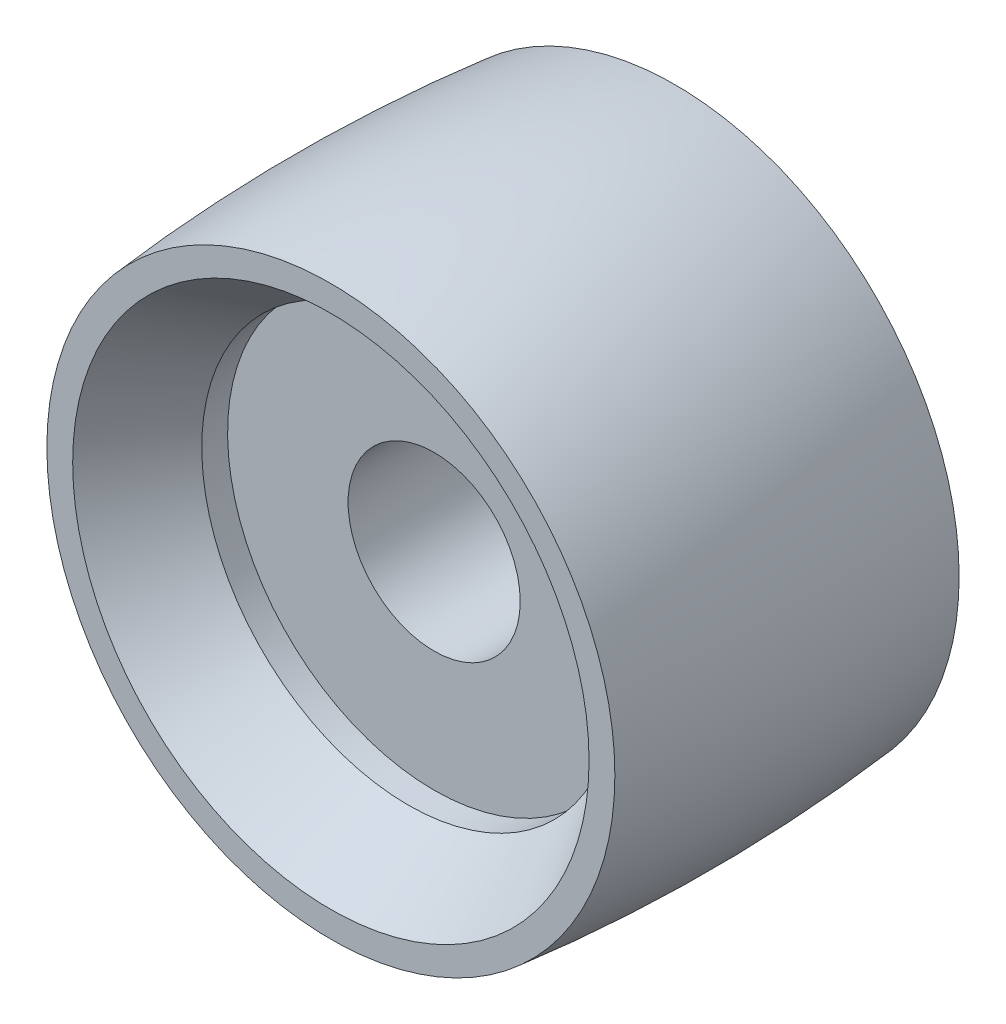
ISO-10303-21;
HEADER;
FILE_DESCRIPTION(('STEP AP214'),'2;1');
FILE_NAME('part.step','',(''),(''),'','','');
FILE_SCHEMA(('AUTOMOTIVE_DESIGN { 1 0 10303 214 1 1 1 1 }'));
ENDSEC;
DATA;
#1=APPLICATION_CONTEXT('core data for automotive mechanical design processes');
#2=APPLICATION_PROTOCOL_DEFINITION('international standard','automotive_design',2000,#1);
#3=PRODUCT_CONTEXT('',#1,'mechanical');
#4=PRODUCT('Part','Part','',(#3));
#5=PRODUCT_RELATED_PRODUCT_CATEGORY('part','',(#4));
#6=PRODUCT_DEFINITION_FORMATION('','',#4);
#7=PRODUCT_DEFINITION_CONTEXT('part definition',#1,'design');
#8=PRODUCT_DEFINITION('design','',#6,#7);
#9=PRODUCT_DEFINITION_SHAPE('','',#8);
#10=(LENGTH_UNIT() NAMED_UNIT(*) SI_UNIT(.MILLI.,.METRE.));
#11=(NAMED_UNIT(*) PLANE_ANGLE_UNIT() SI_UNIT($,.RADIAN.));
#12=(NAMED_UNIT(*) SI_UNIT($,.STERADIAN.) SOLID_ANGLE_UNIT());
#13=UNCERTAINTY_MEASURE_WITH_UNIT(LENGTH_MEASURE(1.E-05),#10,'distance_accuracy_value','');
#14=(GEOMETRIC_REPRESENTATION_CONTEXT(3) GLOBAL_UNCERTAINTY_ASSIGNED_CONTEXT((#13)) GLOBAL_UNIT_ASSIGNED_CONTEXT((#10,
#11,#12)) REPRESENTATION_CONTEXT('',''));
#15=CARTESIAN_POINT('',(0.,0.,0.));
#16=DIRECTION('',(0.,0.,1.));
#17=DIRECTION('',(1.,0.,0.));
#18=AXIS2_PLACEMENT_3D('',#15,#16,#17);
#19=CARTESIAN_POINT('',(0.,0.,4.));
#20=DIRECTION('',(0.,0.,1.));
#21=DIRECTION('',(0.,-1.,0.));
#22=AXIS2_PLACEMENT_3D('',#19,#20,#21);
#23=CYLINDRICAL_SURFACE('',#22,12.);
#24=CARTESIAN_POINT('',(0.,0.,4.));
#25=DIRECTION('',(0.,0.,1.));
#26=DIRECTION('',(0.,-1.,0.));
#27=AXIS2_PLACEMENT_3D('',#24,#25,#26);
#28=CIRCLE('',#27,12.);
#29=CARTESIAN_POINT('',(0.,-12.,4.));
#30=VERTEX_POINT('',#29);
#31=EDGE_CURVE('E16',#30,#30,#28,.F.);
#32=ORIENTED_EDGE('',*,*,#31,.T.);
#33=EDGE_LOOP('',(#32));
#34=FACE_BOUND('',#33,.T.);
#35=CARTESIAN_POINT('',(0.,0.,5.5));
#36=DIRECTION('',(0.,0.,1.));
#37=DIRECTION('',(1.,0.,0.));
#38=AXIS2_PLACEMENT_3D('',#35,#36,#37);
#39=CIRCLE('',#38,12.);
#40=CARTESIAN_POINT('',(12.,0.,5.50000000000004));
#41=VERTEX_POINT('',#40);
#42=EDGE_CURVE('E28',#41,#41,#39,.T.);
#43=ORIENTED_EDGE('',*,*,#42,.T.);
#44=EDGE_LOOP('',(#43));
#45=FACE_BOUND('',#44,.T.);
#46=ADVANCED_FACE('F12',(#34,#45),#23,.F.);
#47=CARTESIAN_POINT('',(0.,0.,5.5));
#48=DIRECTION('',(0.,0.,1.));
#49=DIRECTION('',(1.,0.,0.));
#50=AXIS2_PLACEMENT_3D('',#47,#48,#49);
#51=CONICAL_SURFACE('',#50,12.,0.588002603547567);
#52=ORIENTED_EDGE('',*,*,#42,.F.);
#53=EDGE_LOOP('',(#52));
#54=FACE_BOUND('',#53,.T.);
#55=CARTESIAN_POINT('',(0.,0.,10.));
#56=DIRECTION('',(0.,0.,1.));
#57=DIRECTION('',(1.,0.,0.));
#58=AXIS2_PLACEMENT_3D('',#55,#56,#57);
#59=CIRCLE('',#58,15.);
#60=CARTESIAN_POINT('',(15.,0.,10.));
#61=VERTEX_POINT('',#60);
#62=EDGE_CURVE('E44',#61,#61,#59,.T.);
#63=ORIENTED_EDGE('',*,*,#62,.T.);
#64=EDGE_LOOP('',(#63));
#65=FACE_BOUND('',#64,.T.);
#66=ADVANCED_FACE('F56',(#54,#65),#51,.F.);
#67=CARTESIAN_POINT('',(12.144,-12.185787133,4.));
#68=DIRECTION('',(0.,0.,-1.));
#69=DIRECTION('',(-1.,0.,0.));
#70=AXIS2_PLACEMENT_3D('',#67,#68,#69);
#71=PLANE('',#70);
#72=CARTESIAN_POINT('',(0.,0.,4.));
#73=DIRECTION('',(0.,0.,1.));
#74=DIRECTION('',(1.,0.,0.));
#75=AXIS2_PLACEMENT_3D('',#72,#73,#74);
#76=CIRCLE('',#75,5.);
#77=CARTESIAN_POINT('',(5.,0.,4.));
#78=VERTEX_POINT('',#77);
#79=EDGE_CURVE('E42',#78,#78,#76,.F.);
#80=ORIENTED_EDGE('',*,*,#79,.T.);
#81=EDGE_LOOP('',(#80));
#82=FACE_BOUND('',#81,.T.);
#83=ORIENTED_EDGE('',*,*,#31,.F.);
#84=EDGE_LOOP('',(#83));
#85=FACE_BOUND('',#84,.T.);
#86=ADVANCED_FACE('F53',(#82,#85),#71,.F.);
#87=CARTESIAN_POINT('',(16.696728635,-16.754181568,10.));
#88=DIRECTION('',(0.,0.,-1.));
#89=DIRECTION('',(-1.,0.,0.));
#90=AXIS2_PLACEMENT_3D('',#87,#88,#89);
#91=PLANE('',#90);
#92=ORIENTED_EDGE('',*,*,#62,.F.);
#93=EDGE_LOOP('',(#92));
#94=FACE_BOUND('',#93,.T.);
#95=CARTESIAN_POINT('',(0.,0.,9.99999999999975));
#96=DIRECTION('',(0.,0.,1.));
#97=DIRECTION('',(1.,0.,0.));
#98=AXIS2_PLACEMENT_3D('',#95,#96,#97);
#99=CIRCLE('',#98,16.498743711);
#100=CARTESIAN_POINT('',(16.498743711,0.,9.99999999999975));
#101=VERTEX_POINT('',#100);
#102=EDGE_CURVE('E39',#101,#101,#99,.F.);
#103=ORIENTED_EDGE('',*,*,#102,.F.);
#104=EDGE_LOOP('',(#103));
#105=FACE_BOUND('',#104,.T.);
#106=ADVANCED_FACE('F55',(#94,#105),#91,.F.);
#107=CARTESIAN_POINT('',(0.,0.,-4.));
#108=DIRECTION('',(0.,0.,1.));
#109=DIRECTION('',(1.,0.,0.));
#110=AXIS2_PLACEMENT_3D('',#107,#108,#109);
#111=CYLINDRICAL_SURFACE('',#110,5.);
#112=CARTESIAN_POINT('',(0.,0.,-4.));
#113=DIRECTION('',(0.,0.,1.));
#114=DIRECTION('',(1.,0.,0.));
#115=AXIS2_PLACEMENT_3D('',#112,#113,#114);
#116=CIRCLE('',#115,5.);
#117=CARTESIAN_POINT('',(5.,0.,-4.));
#118=VERTEX_POINT('',#117);
#119=EDGE_CURVE('E36',#118,#118,#116,.F.);
#120=ORIENTED_EDGE('',*,*,#119,.T.);
#121=EDGE_LOOP('',(#120));
#122=FACE_BOUND('',#121,.T.);
#123=ORIENTED_EDGE('',*,*,#79,.F.);
#124=EDGE_LOOP('',(#123));
#125=FACE_BOUND('',#124,.T.);
#126=ADVANCED_FACE('F65',(#122,#125),#111,.F.);
#127=CARTESIAN_POINT('',(0.,0.,0.));
#128=DIRECTION('',(0.,0.,1.));
#129=DIRECTION('',(1.,0.,0.));
#130=AXIS2_PLACEMENT_3D('',#127,#128,#129);
#131=DEGENERATE_TOROIDAL_SURFACE('',#130,83.0000000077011,100.000000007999,.F.);
#132=ORIENTED_EDGE('',*,*,#102,.T.);
#133=EDGE_LOOP('',(#132));
#134=FACE_BOUND('',#133,.T.);
#135=CARTESIAN_POINT('',(0.,0.,-10.0000000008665));
#136=DIRECTION('',(0.,0.,1.));
#137=DIRECTION('',(1.,0.,0.));
#138=AXIS2_PLACEMENT_3D('',#135,#136,#137);
#139=CIRCLE('',#138,16.4987437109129);
#140=CARTESIAN_POINT('',(16.4987437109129,0.,-10.0000000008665));
#141=VERTEX_POINT('',#140);
#142=EDGE_CURVE('E33',#141,#141,#139,.T.);
#143=ORIENTED_EDGE('',*,*,#142,.T.);
#144=EDGE_LOOP('',(#143));
#145=FACE_BOUND('',#144,.T.);
#146=ADVANCED_FACE('F85',(#134,#145),#131,.F.);
#147=CARTESIAN_POINT('',(-12.144,-12.185787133,-4.));
#148=DIRECTION('',(0.,0.,1.));
#149=DIRECTION('',(1.,0.,0.));
#150=AXIS2_PLACEMENT_3D('',#147,#148,#149);
#151=PLANE('',#150);
#152=ORIENTED_EDGE('',*,*,#119,.F.);
#153=EDGE_LOOP('',(#152));
#154=FACE_BOUND('',#153,.T.);
#155=CARTESIAN_POINT('',(0.,0.,-4.));
#156=DIRECTION('',(0.,0.,1.));
#157=DIRECTION('',(1.,0.,0.));
#158=AXIS2_PLACEMENT_3D('',#155,#156,#157);
#159=CIRCLE('',#158,12.);
#160=CARTESIAN_POINT('',(12.,0.,-4.));
#161=VERTEX_POINT('',#160);
#162=EDGE_CURVE('E25',#161,#161,#159,.F.);
#163=ORIENTED_EDGE('',*,*,#162,.T.);
#164=EDGE_LOOP('',(#163));
#165=FACE_BOUND('',#164,.T.);
#166=ADVANCED_FACE('F135',(#154,#165),#151,.F.);
#167=CARTESIAN_POINT('',(-16.696728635,-16.754181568,-10.));
#168=DIRECTION('',(0.,0.,1.));
#169=DIRECTION('',(1.,0.,0.));
#170=AXIS2_PLACEMENT_3D('',#167,#168,#169);
#171=PLANE('',#170);
#172=CARTESIAN_POINT('',(0.,0.,-10.));
#173=DIRECTION('',(0.,0.,-1.));
#174=DIRECTION('',(-1.,0.,0.));
#175=AXIS2_PLACEMENT_3D('',#172,#173,#174);
#176=CIRCLE('',#175,15.);
#177=CARTESIAN_POINT('',(-15.,0.,-10.));
#178=VERTEX_POINT('',#177);
#179=EDGE_CURVE('E20',#178,#178,#176,.F.);
#180=ORIENTED_EDGE('',*,*,#179,.T.);
#181=EDGE_LOOP('',(#180));
#182=FACE_BOUND('',#181,.T.);
#183=ORIENTED_EDGE('',*,*,#142,.F.);
#184=EDGE_LOOP('',(#183));
#185=FACE_BOUND('',#184,.T.);
#186=ADVANCED_FACE('F14',(#182,#185),#171,.F.);
#187=CARTESIAN_POINT('',(0.,0.,-5.5));
#188=DIRECTION('',(0.,0.,1.));
#189=DIRECTION('',(1.,0.,0.));
#190=AXIS2_PLACEMENT_3D('',#187,#188,#189);
#191=CYLINDRICAL_SURFACE('',#190,12.);
#192=ORIENTED_EDGE('',*,*,#162,.F.);
#193=EDGE_LOOP('',(#192));
#194=FACE_BOUND('',#193,.T.);
#195=CARTESIAN_POINT('',(0.,0.,-5.5));
#196=DIRECTION('',(0.,0.,-1.));
#197=DIRECTION('',(-1.,0.,0.));
#198=AXIS2_PLACEMENT_3D('',#195,#196,#197);
#199=CIRCLE('',#198,12.);
#200=CARTESIAN_POINT('',(-12.,0.,-5.49999999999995));
#201=VERTEX_POINT('',#200);
#202=EDGE_CURVE('E8',#201,#201,#199,.T.);
#203=ORIENTED_EDGE('',*,*,#202,.T.);
#204=EDGE_LOOP('',(#203));
#205=FACE_BOUND('',#204,.T.);
#206=ADVANCED_FACE('F73',(#194,#205),#191,.F.);
#207=CARTESIAN_POINT('',(0.,0.,-5.5));
#208=DIRECTION('',(0.,0.,-1.));
#209=DIRECTION('',(-1.,0.,0.));
#210=AXIS2_PLACEMENT_3D('',#207,#208,#209);
#211=CONICAL_SURFACE('',#210,12.,0.588002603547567);
#212=ORIENTED_EDGE('',*,*,#179,.F.);
#213=EDGE_LOOP('',(#212));
#214=FACE_BOUND('',#213,.T.);
#215=ORIENTED_EDGE('',*,*,#202,.F.);
#216=EDGE_LOOP('',(#215));
#217=FACE_BOUND('',#216,.T.);
#218=ADVANCED_FACE('F71',(#214,#217),#211,.F.);
#219=CLOSED_SHELL('',(#46,#66,#86,#106,#126,#146,#166,#186,#206,#218));
#220=MANIFOLD_SOLID_BREP('B1',#219);
#221=ADVANCED_BREP_SHAPE_REPRESENTATION('',(#18,#220),#14);
#222=SHAPE_DEFINITION_REPRESENTATION(#9,#221);
ENDSEC;
END-ISO-10303-21;
